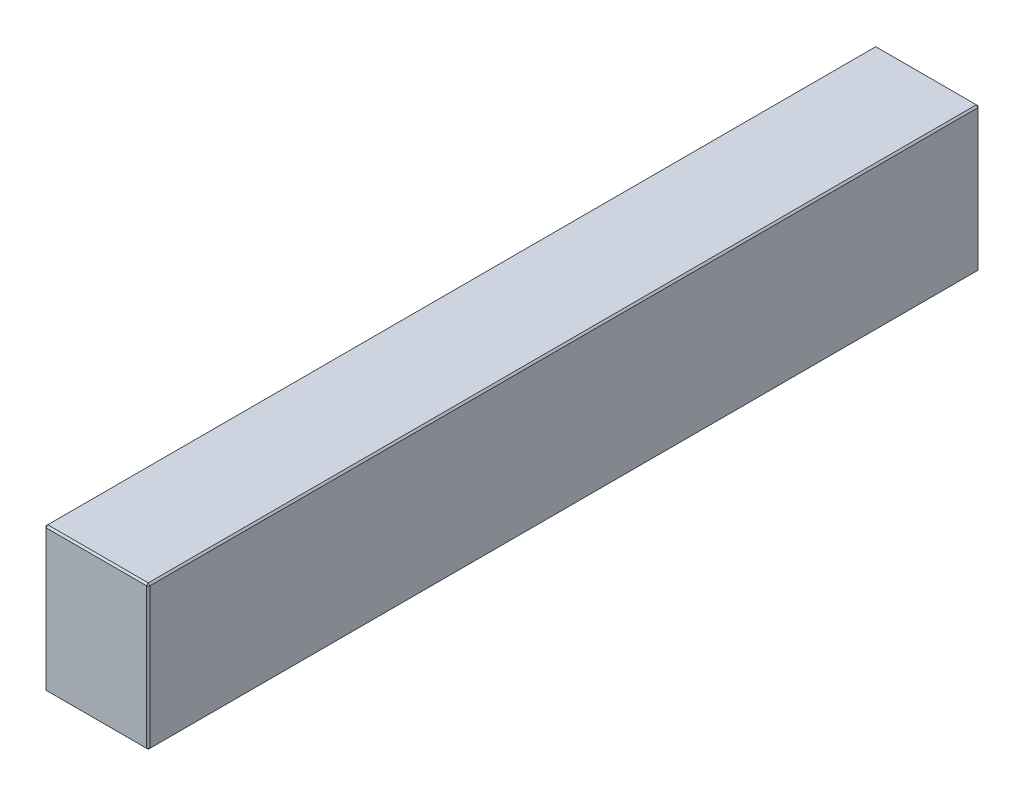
ISO-10303-21;
HEADER;
FILE_DESCRIPTION(('STEP AP214'),'2;1');
FILE_NAME('part.step','',(''),(''),'','','');
FILE_SCHEMA(('AUTOMOTIVE_DESIGN { 1 0 10303 214 1 1 1 1 }'));
ENDSEC;
DATA;
#1=APPLICATION_CONTEXT('core data for automotive mechanical design processes');
#2=APPLICATION_PROTOCOL_DEFINITION('international standard','automotive_design',2000,#1);
#3=PRODUCT_CONTEXT('',#1,'mechanical');
#4=PRODUCT('Part','Part','',(#3));
#5=PRODUCT_RELATED_PRODUCT_CATEGORY('part','',(#4));
#6=PRODUCT_DEFINITION_FORMATION('','',#4);
#7=PRODUCT_DEFINITION_CONTEXT('part definition',#1,'design');
#8=PRODUCT_DEFINITION('design','',#6,#7);
#9=PRODUCT_DEFINITION_SHAPE('','',#8);
#10=(LENGTH_UNIT() NAMED_UNIT(*) SI_UNIT(.MILLI.,.METRE.));
#11=(NAMED_UNIT(*) PLANE_ANGLE_UNIT() SI_UNIT($,.RADIAN.));
#12=(NAMED_UNIT(*) SI_UNIT($,.STERADIAN.) SOLID_ANGLE_UNIT());
#13=UNCERTAINTY_MEASURE_WITH_UNIT(LENGTH_MEASURE(1.E-05),#10,'distance_accuracy_value','');
#14=(GEOMETRIC_REPRESENTATION_CONTEXT(3) GLOBAL_UNCERTAINTY_ASSIGNED_CONTEXT((#13)) GLOBAL_UNIT_ASSIGNED_CONTEXT((#10,
#11,#12)) REPRESENTATION_CONTEXT('',''));
#15=CARTESIAN_POINT('',(0.,0.,0.));
#16=DIRECTION('',(0.,0.,1.));
#17=DIRECTION('',(1.,0.,0.));
#18=AXIS2_PLACEMENT_3D('',#15,#16,#17);
#19=CARTESIAN_POINT('',(-31.,86.,248.));
#20=DIRECTION('',(1.,0.,0.));
#21=DIRECTION('',(0.,0.,-1.));
#22=AXIS2_PLACEMENT_3D('',#19,#20,#21);
#23=PLANE('',#22);
#24=DIRECTION('',(0.,-1.,0.));
#25=VECTOR('',#24,1.);
#26=CARTESIAN_POINT('',(-31.,86.,-247.));
#27=LINE('',#26,#25);
#28=CARTESIAN_POINT('',(-31.,85.,-247.));
#29=VERTEX_POINT('',#28);
#30=CARTESIAN_POINT('',(-31.,0.999999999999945,-247.));
#31=VERTEX_POINT('',#30);
#32=EDGE_CURVE('E114',#29,#31,#27,.T.);
#33=ORIENTED_EDGE('',*,*,#32,.T.);
#34=DIRECTION('',(0.,0.,1.));
#35=VECTOR('',#34,1.);
#36=CARTESIAN_POINT('',(-31.,0.999999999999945,248.));
#37=LINE('',#36,#35);
#38=CARTESIAN_POINT('',(-31.,0.999999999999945,247.));
#39=VERTEX_POINT('',#38);
#40=EDGE_CURVE('E110',#31,#39,#37,.T.);
#41=ORIENTED_EDGE('',*,*,#40,.T.);
#42=DIRECTION('',(0.,1.,0.));
#43=VECTOR('',#42,1.);
#44=CARTESIAN_POINT('',(-31.,86.,247.));
#45=LINE('',#44,#43);
#46=CARTESIAN_POINT('',(-31.,85.,247.));
#47=VERTEX_POINT('',#46);
#48=EDGE_CURVE('E103',#39,#47,#45,.T.);
#49=ORIENTED_EDGE('',*,*,#48,.T.);
#50=DIRECTION('',(0.,0.,-1.));
#51=VECTOR('',#50,1.);
#52=CARTESIAN_POINT('',(-31.,85.,-248.));
#53=LINE('',#52,#51);
#54=EDGE_CURVE('E107',#47,#29,#53,.T.);
#55=ORIENTED_EDGE('',*,*,#54,.T.);
#56=EDGE_LOOP('',(#33,#41,#49,#55));
#57=FACE_BOUND('',#56,.T.);
#58=ADVANCED_FACE('F15',(#57),#23,.F.);
#59=CARTESIAN_POINT('',(31.,86.,248.));
#60=DIRECTION('',(0.,0.,-1.));
#61=DIRECTION('',(-1.,0.,0.));
#62=AXIS2_PLACEMENT_3D('',#59,#60,#61);
#63=PLANE('',#62);
#64=DIRECTION('',(-1.,0.,0.));
#65=VECTOR('',#64,1.);
#66=CARTESIAN_POINT('',(-31.,85.,248.));
#67=LINE('',#66,#65);
#68=CARTESIAN_POINT('',(30.,85.,248.));
#69=VERTEX_POINT('',#68);
#70=CARTESIAN_POINT('',(-30.,85.,248.));
#71=VERTEX_POINT('',#70);
#72=EDGE_CURVE('E164',#69,#71,#67,.T.);
#73=ORIENTED_EDGE('',*,*,#72,.T.);
#74=DIRECTION('',(0.,-1.,0.));
#75=VECTOR('',#74,1.);
#76=CARTESIAN_POINT('',(-30.,86.,248.));
#77=LINE('',#76,#75);
#78=CARTESIAN_POINT('',(-30.,0.999999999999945,248.));
#79=VERTEX_POINT('',#78);
#80=EDGE_CURVE('E122',#71,#79,#77,.T.);
#81=ORIENTED_EDGE('',*,*,#80,.T.);
#82=DIRECTION('',(1.,0.,0.));
#83=VECTOR('',#82,1.);
#84=CARTESIAN_POINT('',(31.,0.999999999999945,248.));
#85=LINE('',#84,#83);
#86=CARTESIAN_POINT('',(30.,0.999999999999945,248.));
#87=VERTEX_POINT('',#86);
#88=EDGE_CURVE('E168',#79,#87,#85,.T.);
#89=ORIENTED_EDGE('',*,*,#88,.T.);
#90=DIRECTION('',(0.,1.,0.));
#91=VECTOR('',#90,1.);
#92=CARTESIAN_POINT('',(30.,86.,248.));
#93=LINE('',#92,#91);
#94=EDGE_CURVE('E166',#87,#69,#93,.T.);
#95=ORIENTED_EDGE('',*,*,#94,.T.);
#96=EDGE_LOOP('',(#73,#81,#89,#95));
#97=FACE_BOUND('',#96,.T.);
#98=ADVANCED_FACE('F275',(#97),#63,.F.);
#99=CARTESIAN_POINT('',(31.,86.,248.));
#100=DIRECTION('',(-1.,0.,0.));
#101=DIRECTION('',(0.,0.,1.));
#102=AXIS2_PLACEMENT_3D('',#99,#100,#101);
#103=PLANE('',#102);
#104=DIRECTION('',(0.,0.,-1.));
#105=VECTOR('',#104,1.);
#106=CARTESIAN_POINT('',(31.,0.999999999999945,248.));
#107=LINE('',#106,#105);
#108=CARTESIAN_POINT('',(31.,0.999999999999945,247.));
#109=VERTEX_POINT('',#108);
#110=CARTESIAN_POINT('',(31.,0.999999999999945,-247.));
#111=VERTEX_POINT('',#110);
#112=EDGE_CURVE('E159',#109,#111,#107,.T.);
#113=ORIENTED_EDGE('',*,*,#112,.T.);
#114=DIRECTION('',(0.,1.,0.));
#115=VECTOR('',#114,1.);
#116=CARTESIAN_POINT('',(31.,86.,-247.));
#117=LINE('',#116,#115);
#118=CARTESIAN_POINT('',(31.,85.,-247.));
#119=VERTEX_POINT('',#118);
#120=EDGE_CURVE('E161',#111,#119,#117,.T.);
#121=ORIENTED_EDGE('',*,*,#120,.T.);
#122=DIRECTION('',(0.,0.,1.));
#123=VECTOR('',#122,1.);
#124=CARTESIAN_POINT('',(31.,85.,248.));
#125=LINE('',#124,#123);
#126=CARTESIAN_POINT('',(31.,85.,247.));
#127=VERTEX_POINT('',#126);
#128=EDGE_CURVE('E155',#119,#127,#125,.T.);
#129=ORIENTED_EDGE('',*,*,#128,.T.);
#130=DIRECTION('',(0.,-1.,0.));
#131=VECTOR('',#130,1.);
#132=CARTESIAN_POINT('',(31.,86.,247.));
#133=LINE('',#132,#131);
#134=EDGE_CURVE('E157',#127,#109,#133,.T.);
#135=ORIENTED_EDGE('',*,*,#134,.T.);
#136=EDGE_LOOP('',(#113,#121,#129,#135));
#137=FACE_BOUND('',#136,.T.);
#138=ADVANCED_FACE('F254',(#137),#103,.F.);
#139=CARTESIAN_POINT('',(31.,86.,-248.));
#140=DIRECTION('',(0.,0.,1.));
#141=DIRECTION('',(1.,0.,0.));
#142=AXIS2_PLACEMENT_3D('',#139,#140,#141);
#143=PLANE('',#142);
#144=DIRECTION('',(0.,-1.,0.));
#145=VECTOR('',#144,1.);
#146=CARTESIAN_POINT('',(30.,86.,-248.));
#147=LINE('',#146,#145);
#148=CARTESIAN_POINT('',(30.,85.,-248.));
#149=VERTEX_POINT('',#148);
#150=CARTESIAN_POINT('',(30.,0.999999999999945,-248.));
#151=VERTEX_POINT('',#150);
#152=EDGE_CURVE('E148',#149,#151,#147,.T.);
#153=ORIENTED_EDGE('',*,*,#152,.T.);
#154=DIRECTION('',(-1.,0.,0.));
#155=VECTOR('',#154,1.);
#156=CARTESIAN_POINT('',(31.,0.999999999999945,-248.));
#157=LINE('',#156,#155);
#158=CARTESIAN_POINT('',(-30.,0.999999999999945,-248.));
#159=VERTEX_POINT('',#158);
#160=EDGE_CURVE('E153',#151,#159,#157,.T.);
#161=ORIENTED_EDGE('',*,*,#160,.T.);
#162=DIRECTION('',(0.,1.,0.));
#163=VECTOR('',#162,1.);
#164=CARTESIAN_POINT('',(-30.,86.,-248.));
#165=LINE('',#164,#163);
#166=CARTESIAN_POINT('',(-30.,85.,-248.));
#167=VERTEX_POINT('',#166);
#168=EDGE_CURVE('E150',#159,#167,#165,.T.);
#169=ORIENTED_EDGE('',*,*,#168,.T.);
#170=DIRECTION('',(1.,0.,0.));
#171=VECTOR('',#170,1.);
#172=CARTESIAN_POINT('',(31.,85.,-248.));
#173=LINE('',#172,#171);
#174=EDGE_CURVE('E146',#167,#149,#173,.T.);
#175=ORIENTED_EDGE('',*,*,#174,.T.);
#176=EDGE_LOOP('',(#153,#161,#169,#175));
#177=FACE_BOUND('',#176,.T.);
#178=ADVANCED_FACE('F284',(#177),#143,.F.);
#179=CARTESIAN_POINT('',(0.,86.,0.));
#180=DIRECTION('',(0.,1.,0.));
#181=DIRECTION('',(0.,0.,1.));
#182=AXIS2_PLACEMENT_3D('',#179,#180,#181);
#183=PLANE('',#182);
#184=DIRECTION('',(0.,0.,-1.));
#185=VECTOR('',#184,1.);
#186=CARTESIAN_POINT('',(30.,86.,-248.));
#187=LINE('',#186,#185);
#188=CARTESIAN_POINT('',(30.,86.,247.));
#189=VERTEX_POINT('',#188);
#190=CARTESIAN_POINT('',(30.,86.,-247.));
#191=VERTEX_POINT('',#190);
#192=EDGE_CURVE('E24',#189,#191,#187,.T.);
#193=ORIENTED_EDGE('',*,*,#192,.T.);
#194=DIRECTION('',(-1.,0.,0.));
#195=VECTOR('',#194,1.);
#196=CARTESIAN_POINT('',(-31.,86.,-247.));
#197=LINE('',#196,#195);
#198=CARTESIAN_POINT('',(-30.,86.,-247.));
#199=VERTEX_POINT('',#198);
#200=EDGE_CURVE('E9',#191,#199,#197,.T.);
#201=ORIENTED_EDGE('',*,*,#200,.T.);
#202=DIRECTION('',(0.,0.,1.));
#203=VECTOR('',#202,1.);
#204=CARTESIAN_POINT('',(-30.,86.,248.));
#205=LINE('',#204,#203);
#206=CARTESIAN_POINT('',(-30.,86.,247.));
#207=VERTEX_POINT('',#206);
#208=EDGE_CURVE('E180',#199,#207,#205,.T.);
#209=ORIENTED_EDGE('',*,*,#208,.T.);
#210=DIRECTION('',(1.,0.,0.));
#211=VECTOR('',#210,1.);
#212=CARTESIAN_POINT('',(31.,86.,247.));
#213=LINE('',#212,#211);
#214=EDGE_CURVE('E35',#207,#189,#213,.T.);
#215=ORIENTED_EDGE('',*,*,#214,.T.);
#216=EDGE_LOOP('',(#193,#201,#209,#215));
#217=FACE_BOUND('',#216,.T.);
#218=ADVANCED_FACE('F350',(#217),#183,.T.);
#219=CARTESIAN_POINT('',(0.,0.,0.));
#220=DIRECTION('',(0.,1.,0.));
#221=DIRECTION('',(0.,0.,1.));
#222=AXIS2_PLACEMENT_3D('',#219,#220,#221);
#223=PLANE('',#222);
#224=DIRECTION('',(0.,0.,1.));
#225=VECTOR('',#224,1.);
#226=CARTESIAN_POINT('',(30.,0.,0.));
#227=LINE('',#226,#225);
#228=CARTESIAN_POINT('',(30.,0.,-247.));
#229=VERTEX_POINT('',#228);
#230=CARTESIAN_POINT('',(30.,0.,247.));
#231=VERTEX_POINT('',#230);
#232=EDGE_CURVE('E171',#229,#231,#227,.T.);
#233=ORIENTED_EDGE('',*,*,#232,.T.);
#234=DIRECTION('',(-1.,0.,0.));
#235=VECTOR('',#234,1.);
#236=CARTESIAN_POINT('',(0.,0.,247.));
#237=LINE('',#236,#235);
#238=CARTESIAN_POINT('',(-30.,0.,247.));
#239=VERTEX_POINT('',#238);
#240=EDGE_CURVE('E177',#231,#239,#237,.T.);
#241=ORIENTED_EDGE('',*,*,#240,.T.);
#242=DIRECTION('',(0.,0.,-1.));
#243=VECTOR('',#242,1.);
#244=CARTESIAN_POINT('',(-30.,0.,0.));
#245=LINE('',#244,#243);
#246=CARTESIAN_POINT('',(-30.,0.,-247.));
#247=VERTEX_POINT('',#246);
#248=EDGE_CURVE('E175',#239,#247,#245,.T.);
#249=ORIENTED_EDGE('',*,*,#248,.T.);
#250=DIRECTION('',(1.,0.,0.));
#251=VECTOR('',#250,1.);
#252=CARTESIAN_POINT('',(0.,0.,-247.));
#253=LINE('',#252,#251);
#254=EDGE_CURVE('E173',#247,#229,#253,.T.);
#255=ORIENTED_EDGE('',*,*,#254,.T.);
#256=EDGE_LOOP('',(#233,#241,#249,#255));
#257=FACE_BOUND('',#256,.T.);
#258=ADVANCED_FACE('F246',(#257),#223,.F.);
#259=CARTESIAN_POINT('',(31.,86.,247.));
#260=DIRECTION('',(-0.707106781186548,0.,-0.707106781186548));
#261=DIRECTION('',(0.,-1.,0.));
#262=AXIS2_PLACEMENT_3D('',#259,#260,#261);
#263=PLANE('',#262);
#264=DIRECTION('',(-0.707106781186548,0.,0.707106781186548));
#265=VECTOR('',#264,1.);
#266=CARTESIAN_POINT('',(30.,85.,248.));
#267=LINE('',#266,#265);
#268=EDGE_CURVE('E19',#69,#127,#267,.F.);
#269=ORIENTED_EDGE('',*,*,#268,.F.);
#270=ORIENTED_EDGE('',*,*,#94,.F.);
#271=DIRECTION('',(0.707106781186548,0.,-0.707106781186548));
#272=VECTOR('',#271,1.);
#273=CARTESIAN_POINT('',(30.,0.999999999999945,248.));
#274=LINE('',#273,#272);
#275=EDGE_CURVE('E142',#109,#87,#274,.F.);
#276=ORIENTED_EDGE('',*,*,#275,.F.);
#277=ORIENTED_EDGE('',*,*,#134,.F.);
#278=EDGE_LOOP('',(#269,#270,#276,#277));
#279=FACE_BOUND('',#278,.T.);
#280=ADVANCED_FACE('F17',(#279),#263,.F.);
#281=CARTESIAN_POINT('',(30.,85.,248.));
#282=DIRECTION('',(0.577350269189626,0.577350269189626,0.577350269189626));
#283=DIRECTION('',(0.707106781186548,0.,-0.707106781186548));
#284=AXIS2_PLACEMENT_3D('',#281,#282,#283);
#285=PLANE('',#284);
#286=DIRECTION('',(0.,-0.707106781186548,0.707106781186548));
#287=VECTOR('',#286,1.);
#288=CARTESIAN_POINT('',(30.,85.,248.));
#289=LINE('',#288,#287);
#290=EDGE_CURVE('E226',#69,#189,#289,.F.);
#291=ORIENTED_EDGE('',*,*,#290,.F.);
#292=ORIENTED_EDGE('',*,*,#268,.T.);
#293=DIRECTION('',(-0.707106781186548,0.707106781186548,0.));
#294=VECTOR('',#293,1.);
#295=CARTESIAN_POINT('',(30.5,85.5,247.));
#296=LINE('',#295,#294);
#297=EDGE_CURVE('E228',#189,#127,#296,.F.);
#298=ORIENTED_EDGE('',*,*,#297,.F.);
#299=EDGE_LOOP('',(#291,#292,#298));
#300=FACE_BOUND('',#299,.T.);
#301=ADVANCED_FACE('F270',(#300),#285,.T.);
#302=CARTESIAN_POINT('',(30.,0.999999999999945,248.));
#303=DIRECTION('',(0.577350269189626,-0.577350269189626,0.577350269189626));
#304=DIRECTION('',(0.707106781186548,0.,-0.707106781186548));
#305=AXIS2_PLACEMENT_3D('',#302,#303,#304);
#306=PLANE('',#305);
#307=DIRECTION('',(-0.707106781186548,-0.707106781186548,0.));
#308=VECTOR('',#307,1.);
#309=CARTESIAN_POINT('',(30.5,0.499999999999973,247.));
#310=LINE('',#309,#308);
#311=EDGE_CURVE('E220',#109,#231,#310,.T.);
#312=ORIENTED_EDGE('',*,*,#311,.F.);
#313=ORIENTED_EDGE('',*,*,#275,.T.);
#314=DIRECTION('',(0.,0.707106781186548,0.707106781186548));
#315=VECTOR('',#314,1.);
#316=CARTESIAN_POINT('',(30.,0.999999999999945,248.));
#317=LINE('',#316,#315);
#318=EDGE_CURVE('E223',#231,#87,#317,.T.);
#319=ORIENTED_EDGE('',*,*,#318,.F.);
#320=EDGE_LOOP('',(#312,#313,#319));
#321=FACE_BOUND('',#320,.T.);
#322=ADVANCED_FACE('F235',(#321),#306,.T.);
#323=CARTESIAN_POINT('',(30.,86.,0.));
#324=DIRECTION('',(0.707106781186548,0.707106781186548,0.));
#325=DIRECTION('',(0.,0.,1.));
#326=AXIS2_PLACEMENT_3D('',#323,#324,#325);
#327=PLANE('',#326);
#328=ORIENTED_EDGE('',*,*,#297,.T.);
#329=ORIENTED_EDGE('',*,*,#128,.F.);
#330=DIRECTION('',(0.707106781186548,-0.707106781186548,0.));
#331=VECTOR('',#330,1.);
#332=CARTESIAN_POINT('',(31.,85.,-247.));
#333=LINE('',#332,#331);
#334=EDGE_CURVE('E215',#191,#119,#333,.T.);
#335=ORIENTED_EDGE('',*,*,#334,.F.);
#336=ORIENTED_EDGE('',*,*,#192,.F.);
#337=EDGE_LOOP('',(#328,#329,#335,#336));
#338=FACE_BOUND('',#337,.T.);
#339=ADVANCED_FACE('F265',(#338),#327,.T.);
#340=CARTESIAN_POINT('',(0.,86.,247.));
#341=DIRECTION('',(0.,0.707106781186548,0.707106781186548));
#342=DIRECTION('',(-1.,0.,0.));
#343=AXIS2_PLACEMENT_3D('',#340,#341,#342);
#344=PLANE('',#343);
#345=ORIENTED_EDGE('',*,*,#290,.T.);
#346=ORIENTED_EDGE('',*,*,#214,.F.);
#347=DIRECTION('',(0.,0.707106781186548,-0.707106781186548));
#348=VECTOR('',#347,1.);
#349=CARTESIAN_POINT('',(-30.,85.5,247.5));
#350=LINE('',#349,#348);
#351=EDGE_CURVE('E126',#71,#207,#350,.T.);
#352=ORIENTED_EDGE('',*,*,#351,.F.);
#353=ORIENTED_EDGE('',*,*,#72,.F.);
#354=EDGE_LOOP('',(#345,#346,#352,#353));
#355=FACE_BOUND('',#354,.T.);
#356=ADVANCED_FACE('F273',(#355),#344,.T.);
#357=CARTESIAN_POINT('',(-30.,86.,248.));
#358=DIRECTION('',(0.707106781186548,0.,-0.707106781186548));
#359=DIRECTION('',(0.,-1.,0.));
#360=AXIS2_PLACEMENT_3D('',#357,#358,#359);
#361=PLANE('',#360);
#362=DIRECTION('',(0.707106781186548,0.,0.707106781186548));
#363=VECTOR('',#362,1.);
#364=CARTESIAN_POINT('',(-30.,0.999999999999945,248.));
#365=LINE('',#364,#363);
#366=EDGE_CURVE('E127',#79,#39,#365,.F.);
#367=ORIENTED_EDGE('',*,*,#366,.F.);
#368=ORIENTED_EDGE('',*,*,#80,.F.);
#369=DIRECTION('',(-0.707106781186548,0.,-0.707106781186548));
#370=VECTOR('',#369,1.);
#371=CARTESIAN_POINT('',(-31.,85.,247.));
#372=LINE('',#371,#370);
#373=EDGE_CURVE('E118',#47,#71,#372,.F.);
#374=ORIENTED_EDGE('',*,*,#373,.F.);
#375=ORIENTED_EDGE('',*,*,#48,.F.);
#376=EDGE_LOOP('',(#367,#368,#374,#375));
#377=FACE_BOUND('',#376,.T.);
#378=ADVANCED_FACE('F120',(#377),#361,.F.);
#379=CARTESIAN_POINT('',(31.,0.999999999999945,248.));
#380=DIRECTION('',(0.,0.707106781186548,-0.707106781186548));
#381=DIRECTION('',(1.,0.,0.));
#382=AXIS2_PLACEMENT_3D('',#379,#380,#381);
#383=PLANE('',#382);
#384=ORIENTED_EDGE('',*,*,#318,.T.);
#385=ORIENTED_EDGE('',*,*,#88,.F.);
#386=DIRECTION('',(0.,-0.707106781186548,-0.707106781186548));
#387=VECTOR('',#386,1.);
#388=CARTESIAN_POINT('',(-30.,0.999999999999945,248.));
#389=LINE('',#388,#387);
#390=EDGE_CURVE('E211',#239,#79,#389,.F.);
#391=ORIENTED_EDGE('',*,*,#390,.F.);
#392=ORIENTED_EDGE('',*,*,#240,.F.);
#393=EDGE_LOOP('',(#384,#385,#391,#392));
#394=FACE_BOUND('',#393,.T.);
#395=ADVANCED_FACE('F243',(#394),#383,.F.);
#396=CARTESIAN_POINT('',(31.,0.999999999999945,248.));
#397=DIRECTION('',(-0.707106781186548,0.707106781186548,0.));
#398=DIRECTION('',(0.,0.,-1.));
#399=AXIS2_PLACEMENT_3D('',#396,#397,#398);
#400=PLANE('',#399);
#401=ORIENTED_EDGE('',*,*,#311,.T.);
#402=ORIENTED_EDGE('',*,*,#232,.F.);
#403=DIRECTION('',(0.707106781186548,0.707106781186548,0.));
#404=VECTOR('',#403,1.);
#405=CARTESIAN_POINT('',(30.5,0.499999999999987,-247.));
#406=LINE('',#405,#404);
#407=EDGE_CURVE('E208',#111,#229,#406,.F.);
#408=ORIENTED_EDGE('',*,*,#407,.F.);
#409=ORIENTED_EDGE('',*,*,#112,.F.);
#410=EDGE_LOOP('',(#401,#402,#408,#409));
#411=FACE_BOUND('',#410,.T.);
#412=ADVANCED_FACE('F251',(#411),#400,.F.);
#413=CARTESIAN_POINT('',(30.,86.,-248.));
#414=DIRECTION('',(-0.707106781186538,0.,0.707106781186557));
#415=DIRECTION('',(0.,-1.,0.));
#416=AXIS2_PLACEMENT_3D('',#413,#414,#415);
#417=PLANE('',#416);
#418=DIRECTION('',(0.707106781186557,0.,0.707106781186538));
#419=VECTOR('',#418,1.);
#420=CARTESIAN_POINT('',(31.,85.,-247.));
#421=LINE('',#420,#419);
#422=EDGE_CURVE('E217',#119,#149,#421,.F.);
#423=ORIENTED_EDGE('',*,*,#422,.F.);
#424=ORIENTED_EDGE('',*,*,#120,.F.);
#425=DIRECTION('',(-0.707106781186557,0.,-0.707106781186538));
#426=VECTOR('',#425,1.);
#427=CARTESIAN_POINT('',(30.,0.999999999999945,-248.));
#428=LINE('',#427,#426);
#429=EDGE_CURVE('E205',#151,#111,#428,.F.);
#430=ORIENTED_EDGE('',*,*,#429,.F.);
#431=ORIENTED_EDGE('',*,*,#152,.F.);
#432=EDGE_LOOP('',(#423,#424,#430,#431));
#433=FACE_BOUND('',#432,.T.);
#434=ADVANCED_FACE('F258',(#433),#417,.F.);
#435=CARTESIAN_POINT('',(31.,85.,-247.));
#436=DIRECTION('',(0.577350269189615,0.577350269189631,-0.577350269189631));
#437=DIRECTION('',(0.,0.707106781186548,0.707106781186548));
#438=AXIS2_PLACEMENT_3D('',#435,#436,#437);
#439=PLANE('',#438);
#440=ORIENTED_EDGE('',*,*,#334,.T.);
#441=ORIENTED_EDGE('',*,*,#422,.T.);
#442=DIRECTION('',(0.,0.707106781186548,0.707106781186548));
#443=VECTOR('',#442,1.);
#444=CARTESIAN_POINT('',(30.,85.5,-247.5));
#445=LINE('',#444,#443);
#446=EDGE_CURVE('E134',#191,#149,#445,.F.);
#447=ORIENTED_EDGE('',*,*,#446,.F.);
#448=EDGE_LOOP('',(#440,#441,#447));
#449=FACE_BOUND('',#448,.T.);
#450=ADVANCED_FACE('F325',(#449),#439,.T.);
#451=CARTESIAN_POINT('',(-31.,85.,247.));
#452=DIRECTION('',(-0.577350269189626,0.577350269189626,0.577350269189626));
#453=DIRECTION('',(0.707106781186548,0.,0.707106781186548));
#454=AXIS2_PLACEMENT_3D('',#451,#452,#453);
#455=PLANE('',#454);
#456=ORIENTED_EDGE('',*,*,#373,.T.);
#457=ORIENTED_EDGE('',*,*,#351,.T.);
#458=DIRECTION('',(-0.707106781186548,-0.707106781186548,0.));
#459=VECTOR('',#458,1.);
#460=CARTESIAN_POINT('',(-31.,85.,247.));
#461=LINE('',#460,#459);
#462=EDGE_CURVE('E130',#47,#207,#461,.F.);
#463=ORIENTED_EDGE('',*,*,#462,.F.);
#464=EDGE_LOOP('',(#456,#457,#463));
#465=FACE_BOUND('',#464,.T.);
#466=ADVANCED_FACE('F131',(#465),#455,.T.);
#467=CARTESIAN_POINT('',(-30.,0.999999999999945,248.));
#468=DIRECTION('',(-0.577350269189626,-0.577350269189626,0.577350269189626));
#469=DIRECTION('',(0.707106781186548,0.,0.707106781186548));
#470=AXIS2_PLACEMENT_3D('',#467,#468,#469);
#471=PLANE('',#470);
#472=ORIENTED_EDGE('',*,*,#390,.T.);
#473=ORIENTED_EDGE('',*,*,#366,.T.);
#474=DIRECTION('',(-0.707106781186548,0.707106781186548,0.));
#475=VECTOR('',#474,1.);
#476=CARTESIAN_POINT('',(-30.5,0.499999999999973,247.));
#477=LINE('',#476,#475);
#478=EDGE_CURVE('E135',#239,#39,#477,.T.);
#479=ORIENTED_EDGE('',*,*,#478,.F.);
#480=EDGE_LOOP('',(#472,#473,#479));
#481=FACE_BOUND('',#480,.T.);
#482=ADVANCED_FACE('F318',(#481),#471,.T.);
#483=CARTESIAN_POINT('',(30.,0.999999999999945,-248.));
#484=DIRECTION('',(0.577350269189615,-0.577350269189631,-0.577350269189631));
#485=DIRECTION('',(0.,0.707106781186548,-0.707106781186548));
#486=AXIS2_PLACEMENT_3D('',#483,#484,#485);
#487=PLANE('',#486);
#488=ORIENTED_EDGE('',*,*,#429,.T.);
#489=ORIENTED_EDGE('',*,*,#407,.T.);
#490=DIRECTION('',(0.,-0.707106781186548,0.707106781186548));
#491=VECTOR('',#490,1.);
#492=CARTESIAN_POINT('',(30.,0.999999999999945,-248.));
#493=LINE('',#492,#491);
#494=EDGE_CURVE('E198',#151,#229,#493,.T.);
#495=ORIENTED_EDGE('',*,*,#494,.F.);
#496=EDGE_LOOP('',(#488,#489,#495));
#497=FACE_BOUND('',#496,.T.);
#498=ADVANCED_FACE('F314',(#497),#487,.T.);
#499=CARTESIAN_POINT('',(0.,86.,-247.));
#500=DIRECTION('',(0.,0.707106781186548,-0.707106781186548));
#501=DIRECTION('',(1.,0.,0.));
#502=AXIS2_PLACEMENT_3D('',#499,#500,#501);
#503=PLANE('',#502);
#504=ORIENTED_EDGE('',*,*,#446,.T.);
#505=ORIENTED_EDGE('',*,*,#174,.F.);
#506=DIRECTION('',(0.,-0.707106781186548,-0.707106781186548));
#507=VECTOR('',#506,1.);
#508=CARTESIAN_POINT('',(-30.,85.,-248.));
#509=LINE('',#508,#507);
#510=EDGE_CURVE('E195',#199,#167,#509,.T.);
#511=ORIENTED_EDGE('',*,*,#510,.F.);
#512=ORIENTED_EDGE('',*,*,#200,.F.);
#513=EDGE_LOOP('',(#504,#505,#511,#512));
#514=FACE_BOUND('',#513,.T.);
#515=ADVANCED_FACE('F311',(#514),#503,.T.);
#516=CARTESIAN_POINT('',(-30.,86.,0.));
#517=DIRECTION('',(-0.707106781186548,0.707106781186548,0.));
#518=DIRECTION('',(0.,0.,-1.));
#519=AXIS2_PLACEMENT_3D('',#516,#517,#518);
#520=PLANE('',#519);
#521=ORIENTED_EDGE('',*,*,#462,.T.);
#522=ORIENTED_EDGE('',*,*,#208,.F.);
#523=DIRECTION('',(0.707106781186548,0.707106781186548,0.));
#524=VECTOR('',#523,1.);
#525=CARTESIAN_POINT('',(-30.5,85.5,-247.));
#526=LINE('',#525,#524);
#527=EDGE_CURVE('E138',#29,#199,#526,.T.);
#528=ORIENTED_EDGE('',*,*,#527,.F.);
#529=ORIENTED_EDGE('',*,*,#54,.F.);
#530=EDGE_LOOP('',(#521,#522,#528,#529));
#531=FACE_BOUND('',#530,.T.);
#532=ADVANCED_FACE('F137',(#531),#520,.T.);
#533=CARTESIAN_POINT('',(-31.,0.999999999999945,248.));
#534=DIRECTION('',(0.707106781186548,0.707106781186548,0.));
#535=DIRECTION('',(0.,0.,1.));
#536=AXIS2_PLACEMENT_3D('',#533,#534,#535);
#537=PLANE('',#536);
#538=ORIENTED_EDGE('',*,*,#478,.T.);
#539=ORIENTED_EDGE('',*,*,#40,.F.);
#540=DIRECTION('',(0.707106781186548,-0.707106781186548,0.));
#541=VECTOR('',#540,1.);
#542=CARTESIAN_POINT('',(-31.,0.999999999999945,-247.));
#543=LINE('',#542,#541);
#544=EDGE_CURVE('E191',#247,#31,#543,.F.);
#545=ORIENTED_EDGE('',*,*,#544,.F.);
#546=ORIENTED_EDGE('',*,*,#248,.F.);
#547=EDGE_LOOP('',(#538,#539,#545,#546));
#548=FACE_BOUND('',#547,.T.);
#549=ADVANCED_FACE('F304',(#548),#537,.F.);
#550=CARTESIAN_POINT('',(31.,0.999999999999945,-248.));
#551=DIRECTION('',(0.,0.707106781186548,0.707106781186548));
#552=DIRECTION('',(-1.,0.,0.));
#553=AXIS2_PLACEMENT_3D('',#550,#551,#552);
#554=PLANE('',#553);
#555=ORIENTED_EDGE('',*,*,#494,.T.);
#556=ORIENTED_EDGE('',*,*,#254,.F.);
#557=DIRECTION('',(0.,0.707106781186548,-0.707106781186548));
#558=VECTOR('',#557,1.);
#559=CARTESIAN_POINT('',(-30.,0.499999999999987,-247.5));
#560=LINE('',#559,#558);
#561=EDGE_CURVE('E188',#159,#247,#560,.F.);
#562=ORIENTED_EDGE('',*,*,#561,.F.);
#563=ORIENTED_EDGE('',*,*,#160,.F.);
#564=EDGE_LOOP('',(#555,#556,#562,#563));
#565=FACE_BOUND('',#564,.T.);
#566=ADVANCED_FACE('F300',(#565),#554,.F.);
#567=CARTESIAN_POINT('',(-30.,85.,-248.));
#568=DIRECTION('',(-0.577350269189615,0.577350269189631,-0.577350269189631));
#569=DIRECTION('',(0.,0.707106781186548,0.707106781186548));
#570=AXIS2_PLACEMENT_3D('',#567,#568,#569);
#571=PLANE('',#570);
#572=ORIENTED_EDGE('',*,*,#527,.T.);
#573=ORIENTED_EDGE('',*,*,#510,.T.);
#574=DIRECTION('',(0.707106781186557,0.,-0.707106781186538));
#575=VECTOR('',#574,1.);
#576=CARTESIAN_POINT('',(-30.,85.,-248.));
#577=LINE('',#576,#575);
#578=EDGE_CURVE('E186',#29,#167,#577,.T.);
#579=ORIENTED_EDGE('',*,*,#578,.F.);
#580=EDGE_LOOP('',(#572,#573,#579));
#581=FACE_BOUND('',#580,.T.);
#582=ADVANCED_FACE('F296',(#581),#571,.T.);
#583=CARTESIAN_POINT('',(-31.,0.999999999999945,-247.));
#584=DIRECTION('',(-0.577350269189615,-0.577350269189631,-0.577350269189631));
#585=DIRECTION('',(0.,0.707106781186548,-0.707106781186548));
#586=AXIS2_PLACEMENT_3D('',#583,#584,#585);
#587=PLANE('',#586);
#588=ORIENTED_EDGE('',*,*,#561,.T.);
#589=ORIENTED_EDGE('',*,*,#544,.T.);
#590=DIRECTION('',(-0.707106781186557,0.,0.707106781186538));
#591=VECTOR('',#590,1.);
#592=CARTESIAN_POINT('',(-31.,0.999999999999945,-247.));
#593=LINE('',#592,#591);
#594=EDGE_CURVE('E184',#159,#31,#593,.T.);
#595=ORIENTED_EDGE('',*,*,#594,.F.);
#596=EDGE_LOOP('',(#588,#589,#595));
#597=FACE_BOUND('',#596,.T.);
#598=ADVANCED_FACE('F292',(#597),#587,.T.);
#599=CARTESIAN_POINT('',(-31.,86.,-247.));
#600=DIRECTION('',(0.707106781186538,0.,0.707106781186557));
#601=DIRECTION('',(0.,-1.,0.));
#602=AXIS2_PLACEMENT_3D('',#599,#600,#601);
#603=PLANE('',#602);
#604=ORIENTED_EDGE('',*,*,#578,.T.);
#605=ORIENTED_EDGE('',*,*,#168,.F.);
#606=ORIENTED_EDGE('',*,*,#594,.T.);
#607=ORIENTED_EDGE('',*,*,#32,.F.);
#608=EDGE_LOOP('',(#604,#605,#606,#607));
#609=FACE_BOUND('',#608,.T.);
#610=ADVANCED_FACE('F289',(#609),#603,.F.);
#611=CLOSED_SHELL('',(#58,#98,#138,#178,#218,#258,#280,#301,#322,#339,#356,#378,#395,#412,#434,
#450,#466,#482,#498,#515,#532,#549,#566,#582,#598,#610));
#612=MANIFOLD_SOLID_BREP('B1',#611);
#613=ADVANCED_BREP_SHAPE_REPRESENTATION('',(#18,#612),#14);
#614=SHAPE_DEFINITION_REPRESENTATION(#9,#613);
ENDSEC;
END-ISO-10303-21;
